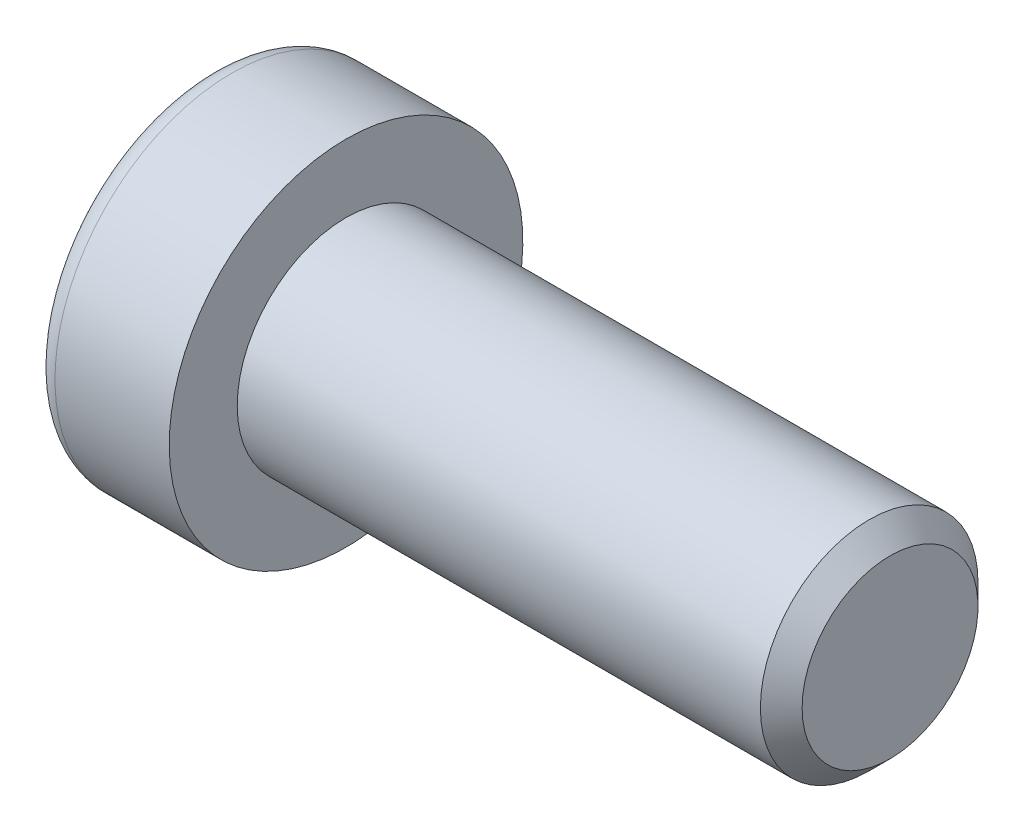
ISO-10303-21;
HEADER;
FILE_DESCRIPTION(('STEP AP214'),'2;1');
FILE_NAME('part.step','',(''),(''),'','','');
FILE_SCHEMA(('AUTOMOTIVE_DESIGN { 1 0 10303 214 1 1 1 1 }'));
ENDSEC;
DATA;
#1=APPLICATION_CONTEXT('core data for automotive mechanical design processes');
#2=APPLICATION_PROTOCOL_DEFINITION('international standard','automotive_design',2000,#1);
#3=PRODUCT_CONTEXT('',#1,'mechanical');
#4=PRODUCT('Part','Part','',(#3));
#5=PRODUCT_RELATED_PRODUCT_CATEGORY('part','',(#4));
#6=PRODUCT_DEFINITION_FORMATION('','',#4);
#7=PRODUCT_DEFINITION_CONTEXT('part definition',#1,'design');
#8=PRODUCT_DEFINITION('design','',#6,#7);
#9=PRODUCT_DEFINITION_SHAPE('','',#8);
#10=(LENGTH_UNIT() NAMED_UNIT(*) SI_UNIT(.MILLI.,.METRE.));
#11=(NAMED_UNIT(*) PLANE_ANGLE_UNIT() SI_UNIT($,.RADIAN.));
#12=(NAMED_UNIT(*) SI_UNIT($,.STERADIAN.) SOLID_ANGLE_UNIT());
#13=UNCERTAINTY_MEASURE_WITH_UNIT(LENGTH_MEASURE(1.E-05),#10,'distance_accuracy_value','');
#14=(GEOMETRIC_REPRESENTATION_CONTEXT(3) GLOBAL_UNCERTAINTY_ASSIGNED_CONTEXT((#13)) GLOBAL_UNIT_ASSIGNED_CONTEXT((#10,
#11,#12)) REPRESENTATION_CONTEXT('',''));
#15=CARTESIAN_POINT('',(0.,0.,0.));
#16=DIRECTION('',(0.,0.,1.));
#17=DIRECTION('',(1.,0.,0.));
#18=AXIS2_PLACEMENT_3D('',#15,#16,#17);
#19=CARTESIAN_POINT('',(-1.21000000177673,0.,0.));
#20=DIRECTION('',(-1.,0.,0.));
#21=DIRECTION('',(0.,0.,1.));
#22=AXIS2_PLACEMENT_3D('',#19,#20,#21);
#23=CONICAL_SURFACE('',#22,2.9040718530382,1.04719754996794);
#24=CARTESIAN_POINT('',(0.466666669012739,-1.13686837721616E-10,0.));
#25=VERTEX_POINT('',#24);
#26=VERTEX_LOOP('',#25);
#27=FACE_BOUND('',#26,.T.);
#28=CARTESIAN_POINT('',(-1.20000000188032,2.50000000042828,1.44337567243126));
#29=CARTESIAN_POINT('',(-1.16336943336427,2.50000000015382,1.31652043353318));
#30=CARTESIAN_POINT('',(-1.13005584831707,2.50000000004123,1.18857018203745));
#31=CARTESIAN_POINT('',(-1.07190798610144,2.49999999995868,0.930454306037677));
#32=CARTESIAN_POINT('',(-1.04709427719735,2.49999999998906,0.800284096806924));
#33=CARTESIAN_POINT('',(-1.00846995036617,2.50000000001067,0.541556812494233));
#34=CARTESIAN_POINT('',(-0.994402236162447,2.50000000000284,0.413039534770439));
#35=CARTESIAN_POINT('',(-0.977611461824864,2.49999999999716,0.155400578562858));
#36=CARTESIAN_POINT('',(-0.974874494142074,2.49999999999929,0.02627983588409));
#37=CARTESIAN_POINT('',(-0.980582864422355,2.50000000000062,-0.21496841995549));
#38=CARTESIAN_POINT('',(-0.987626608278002,2.50000000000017,-0.327132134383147));
#39=CARTESIAN_POINT('',(-1.00994662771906,2.49999999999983,-0.550728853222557));
#40=CARTESIAN_POINT('',(-1.02523052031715,2.49999999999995,-0.66216108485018));
#41=CARTESIAN_POINT('',(-1.06343729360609,2.50000000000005,-0.886218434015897));
#42=CARTESIAN_POINT('',(-1.08652205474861,2.50000000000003,-0.998815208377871));
#43=CARTESIAN_POINT('',(-1.13891470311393,2.49999999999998,-1.2223298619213));
#44=CARTESIAN_POINT('',(-1.16821028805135,2.49999999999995,-1.33325060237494));
#45=CARTESIAN_POINT('',(-1.20000000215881,2.5,-1.44337567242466));
#46=B_SPLINE_CURVE_WITH_KNOTS('',3,(#28,#29,#30,#31,#32,#33,#34,#35,#36,#37,#38,#39,#40,#41,#42,
#43,#44,#45),.UNSPECIFIED.,.F.,.F.,(4,2,2,2,2,2,2,2,4),(0.,0.396270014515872,0.793492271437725,
1.18088450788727,1.56780111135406,1.90463472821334,2.24178024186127,2.58640202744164,
2.93034746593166),.UNSPECIFIED.);
#47=CARTESIAN_POINT('',(-1.20000000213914,2.49999999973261,1.44337567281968));
#48=VERTEX_POINT('',#47);
#49=CARTESIAN_POINT('',(-1.20000000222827,2.5,-1.44337567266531));
#50=VERTEX_POINT('',#49);
#51=EDGE_CURVE('E20',#48,#50,#46,.T.);
#52=ORIENTED_EDGE('',*,*,#51,.T.);
#53=CARTESIAN_POINT('',(-1.20000000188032,2.49999999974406,-1.44337567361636));
#54=CARTESIAN_POINT('',(-1.16336943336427,2.39014014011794,-1.50680329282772));
#55=CARTESIAN_POINT('',(-1.13005584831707,2.27933197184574,-1.57077841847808));
#56=CARTESIAN_POINT('',(-1.07190798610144,2.05579706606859,-1.69983635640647));
#57=CARTESIAN_POINT('',(-1.04709427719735,1.94306635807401,-1.76492146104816));
#58=CARTESIAN_POINT('',(-1.00846995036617,1.71900195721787,-1.89428510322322));
#59=CARTESIAN_POINT('',(-0.994402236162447,1.60770272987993,-1.95854374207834));
#60=CARTESIAN_POINT('',(-0.977611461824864,1.38458084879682,-2.08736322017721));
#61=CARTESIAN_POINT('',(-0.974874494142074,1.27275900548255,-2.15192359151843));
#62=CARTESIAN_POINT('',(-0.980582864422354,1.06383188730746,-2.27254771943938));
#63=CARTESIAN_POINT('',(-0.987626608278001,0.966695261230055,-2.32862957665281));
#64=CARTESIAN_POINT('',(-1.00994662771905,0.773054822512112,-2.44042793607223));
#65=CARTESIAN_POINT('',(-1.02523052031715,0.676551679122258,-2.49614405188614));
#66=CARTESIAN_POINT('',(-1.06343729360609,0.482512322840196,-2.60817272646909));
#67=CARTESIAN_POINT('',(-1.08652205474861,0.385000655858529,-2.66447111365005));
#68=CARTESIAN_POINT('',(-1.13891470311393,0.191431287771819,-2.77622844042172));
#69=CARTESIAN_POINT('',(-1.16821028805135,0.09537110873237,-2.83168881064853));
#70=CARTESIAN_POINT('',(-1.20000000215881,4.75795596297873E-10,-2.88675134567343));
#71=B_SPLINE_CURVE_WITH_KNOTS('',3,(#53,#54,#55,#56,#57,#58,#59,#60,#61,#62,#63,#64,#65,#66,#67,
#68,#69,#70),.UNSPECIFIED.,.F.,.F.,(4,2,2,2,2,2,2,2,4),(0.,0.396270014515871,0.793492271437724,
1.18088450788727,1.56780111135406,1.90463472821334,2.24178024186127,2.58640202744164,
2.93034746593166),.UNSPECIFIED.);
#72=CARTESIAN_POINT('',(-1.20000000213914,0.,-2.88675134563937));
#73=VERTEX_POINT('',#72);
#74=EDGE_CURVE('E80',#50,#73,#71,.T.);
#75=ORIENTED_EDGE('',*,*,#74,.T.);
#76=CARTESIAN_POINT('',(-1.20000000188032,-6.84219602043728E-10,-2.88675134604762));
#77=CARTESIAN_POINT('',(-1.16336943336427,-0.109859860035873,-2.8233237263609));
#78=CARTESIAN_POINT('',(-1.13005584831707,-0.220668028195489,-2.75934860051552));
#79=CARTESIAN_POINT('',(-1.07190798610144,-0.444202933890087,-2.63029066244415));
#80=CARTESIAN_POINT('',(-1.04709427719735,-0.556933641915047,-2.56520555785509));
#81=CARTESIAN_POINT('',(-1.00846995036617,-0.780998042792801,-2.43584191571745));
#82=CARTESIAN_POINT('',(-0.994402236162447,-0.892297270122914,-2.37158327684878));
#83=CARTESIAN_POINT('',(-0.977611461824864,-1.11541915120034,-2.24276379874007));
#84=CARTESIAN_POINT('',(-0.974874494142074,-1.22724099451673,-2.17820342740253));
#85=CARTESIAN_POINT('',(-0.980582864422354,-1.43616811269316,-2.05757929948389));
#86=CARTESIAN_POINT('',(-0.987626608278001,-1.53330473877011,-2.00149744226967));
#87=CARTESIAN_POINT('',(-1.00994662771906,-1.72694517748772,-1.88969908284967));
#88=CARTESIAN_POINT('',(-1.02523052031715,-1.82344832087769,-1.83398296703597));
#89=CARTESIAN_POINT('',(-1.06343729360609,-2.01748767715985,-1.72195429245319));
#90=CARTESIAN_POINT('',(-1.08652205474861,-2.1149993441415,-1.66565590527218));
#91=CARTESIAN_POINT('',(-1.13891470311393,-2.30856871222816,-1.55389857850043));
#92=CARTESIAN_POINT('',(-1.16821028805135,-2.40462889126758,-1.49843820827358));
#93=CARTESIAN_POINT('',(-1.20000000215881,-2.49999999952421,-1.44337567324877));
#94=B_SPLINE_CURVE_WITH_KNOTS('',3,(#76,#77,#78,#79,#80,#81,#82,#83,#84,#85,#86,#87,#88,#89,#90,
#91,#92,#93),.UNSPECIFIED.,.F.,.F.,(4,2,2,2,2,2,2,2,4),(0.,0.396270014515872,0.793492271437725,
1.18088450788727,1.56780111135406,1.90463472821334,2.24178024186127,2.58640202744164,
2.93034746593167),.UNSPECIFIED.);
#95=CARTESIAN_POINT('',(-1.20000000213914,-2.49999999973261,-1.44337567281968));
#96=VERTEX_POINT('',#95);
#97=EDGE_CURVE('E105',#73,#96,#94,.T.);
#98=ORIENTED_EDGE('',*,*,#97,.T.);
#99=CARTESIAN_POINT('',(-1.20000000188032,-2.50000000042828,-1.44337567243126));
#100=CARTESIAN_POINT('',(-1.16336943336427,-2.50000000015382,-1.31652043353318));
#101=CARTESIAN_POINT('',(-1.13005584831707,-2.50000000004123,-1.18857018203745));
#102=CARTESIAN_POINT('',(-1.07190798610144,-2.49999999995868,-0.93045430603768));
#103=CARTESIAN_POINT('',(-1.04709427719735,-2.49999999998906,-0.800284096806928));
#104=CARTESIAN_POINT('',(-1.00846995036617,-2.50000000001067,-0.541556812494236));
#105=CARTESIAN_POINT('',(-0.994402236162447,-2.50000000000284,-0.413039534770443));
#106=CARTESIAN_POINT('',(-0.977611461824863,-2.49999999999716,-0.155400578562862));
#107=CARTESIAN_POINT('',(-0.974874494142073,-2.49999999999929,-0.0262798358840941));
#108=CARTESIAN_POINT('',(-0.980582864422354,-2.50000000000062,0.214968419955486));
#109=CARTESIAN_POINT('',(-0.987626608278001,-2.50000000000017,0.327132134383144));
#110=CARTESIAN_POINT('',(-1.00994662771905,-2.49999999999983,0.550728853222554));
#111=CARTESIAN_POINT('',(-1.02523052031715,-2.49999999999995,0.662161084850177));
#112=CARTESIAN_POINT('',(-1.06343729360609,-2.50000000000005,0.886218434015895));
#113=CARTESIAN_POINT('',(-1.08652205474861,-2.50000000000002,0.99881520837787));
#114=CARTESIAN_POINT('',(-1.13891470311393,-2.49999999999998,1.2223298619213));
#115=CARTESIAN_POINT('',(-1.16821028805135,-2.49999999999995,1.33325060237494));
#116=CARTESIAN_POINT('',(-1.20000000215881,-2.5,1.44337567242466));
#117=B_SPLINE_CURVE_WITH_KNOTS('',3,(#99,#100,#101,#102,#103,#104,#105,#106,#107,#108,#109,#110,
#111,#112,#113,#114,#115,#116),.UNSPECIFIED.,.F.,.F.,(4,2,2,2,2,2,2,2,4),(0.,0.396270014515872,
0.793492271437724,1.18088450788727,1.56780111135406,1.90463472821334,2.24178024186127,
2.58640202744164,2.93034746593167),.UNSPECIFIED.);
#118=CARTESIAN_POINT('',(-1.20000000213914,-2.49999999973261,1.44337567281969));
#119=VERTEX_POINT('',#118);
#120=EDGE_CURVE('E129',#96,#119,#117,.T.);
#121=ORIENTED_EDGE('',*,*,#120,.T.);
#122=CARTESIAN_POINT('',(-1.20000000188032,-2.49999999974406,1.44337567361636));
#123=CARTESIAN_POINT('',(-1.16336943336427,-2.39014014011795,1.50680329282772));
#124=CARTESIAN_POINT('',(-1.13005584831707,-2.27933197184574,1.57077841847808));
#125=CARTESIAN_POINT('',(-1.07190798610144,-2.05579706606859,1.69983635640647));
#126=CARTESIAN_POINT('',(-1.04709427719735,-1.94306635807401,1.76492146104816));
#127=CARTESIAN_POINT('',(-1.00846995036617,-1.71900195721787,1.89428510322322));
#128=CARTESIAN_POINT('',(-0.994402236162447,-1.60770272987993,1.95854374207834));
#129=CARTESIAN_POINT('',(-0.977611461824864,-1.38458084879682,2.08736322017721));
#130=CARTESIAN_POINT('',(-0.974874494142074,-1.27275900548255,2.15192359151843));
#131=CARTESIAN_POINT('',(-0.980582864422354,-1.06383188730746,2.27254771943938));
#132=CARTESIAN_POINT('',(-0.987626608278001,-0.966695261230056,2.32862957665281));
#133=CARTESIAN_POINT('',(-1.00994662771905,-0.773054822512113,2.44042793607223));
#134=CARTESIAN_POINT('',(-1.02523052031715,-0.676551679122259,2.49614405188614));
#135=CARTESIAN_POINT('',(-1.06343729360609,-0.482512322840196,2.60817272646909));
#136=CARTESIAN_POINT('',(-1.08652205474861,-0.385000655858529,2.66447111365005));
#137=CARTESIAN_POINT('',(-1.13891470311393,-0.19143128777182,2.77622844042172));
#138=CARTESIAN_POINT('',(-1.16821028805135,-0.0953711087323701,2.83168881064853));
#139=CARTESIAN_POINT('',(-1.20000000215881,-4.7579556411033E-10,2.88675134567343));
#140=B_SPLINE_CURVE_WITH_KNOTS('',3,(#122,#123,#124,#125,#126,#127,#128,#129,#130,#131,#132,
#133,#134,#135,#136,#137,#138,#139),.UNSPECIFIED.,.F.,.F.,(4,2,2,2,2,2,2,2,4),(0.,
0.396270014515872,0.793492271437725,1.18088450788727,1.56780111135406,1.90463472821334,
2.24178024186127,2.58640202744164,2.93034746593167),.UNSPECIFIED.);
#141=CARTESIAN_POINT('',(-1.20000000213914,0.,2.88675134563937));
#142=VERTEX_POINT('',#141);
#143=EDGE_CURVE('E137',#119,#142,#140,.T.);
#144=ORIENTED_EDGE('',*,*,#143,.T.);
#145=CARTESIAN_POINT('',(-1.20000000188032,6.84218409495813E-10,2.88675134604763));
#146=CARTESIAN_POINT('',(-1.16336943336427,0.109859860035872,2.8233237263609));
#147=CARTESIAN_POINT('',(-1.13005584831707,0.220668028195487,2.75934860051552));
#148=CARTESIAN_POINT('',(-1.07190798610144,0.444202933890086,2.63029066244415));
#149=CARTESIAN_POINT('',(-1.04709427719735,0.556933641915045,2.56520555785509));
#150=CARTESIAN_POINT('',(-1.00846995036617,0.780998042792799,2.43584191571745));
#151=CARTESIAN_POINT('',(-0.994402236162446,0.892297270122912,2.37158327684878));
#152=CARTESIAN_POINT('',(-0.977611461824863,1.11541915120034,2.24276379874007));
#153=CARTESIAN_POINT('',(-0.974874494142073,1.22724099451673,2.17820342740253));
#154=CARTESIAN_POINT('',(-0.980582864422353,1.43616811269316,2.05757929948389));
#155=CARTESIAN_POINT('',(-0.987626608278,1.53330473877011,2.00149744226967));
#156=CARTESIAN_POINT('',(-1.00994662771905,1.72694517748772,1.88969908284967));
#157=CARTESIAN_POINT('',(-1.02523052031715,1.82344832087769,1.83398296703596));
#158=CARTESIAN_POINT('',(-1.06343729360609,2.01748767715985,1.72195429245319));
#159=CARTESIAN_POINT('',(-1.08652205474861,2.1149993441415,1.66565590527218));
#160=CARTESIAN_POINT('',(-1.13891470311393,2.30856871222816,1.55389857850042));
#161=CARTESIAN_POINT('',(-1.16821028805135,2.40462889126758,1.49843820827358));
#162=CARTESIAN_POINT('',(-1.2000000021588,2.49999999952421,1.44337567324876));
#163=B_SPLINE_CURVE_WITH_KNOTS('',3,(#145,#146,#147,#148,#149,#150,#151,#152,#153,#154,#155,
#156,#157,#158,#159,#160,#161,#162),.UNSPECIFIED.,.F.,.F.,(4,2,2,2,2,2,2,2,4),(0.,
0.396270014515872,0.793492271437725,1.18088450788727,1.56780111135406,1.90463472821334,
2.24178024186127,2.58640202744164,2.93034746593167),.UNSPECIFIED.);
#164=EDGE_CURVE('E82',#142,#48,#163,.T.);
#165=ORIENTED_EDGE('',*,*,#164,.T.);
#166=EDGE_LOOP('',(#52,#75,#98,#121,#144,#165));
#167=FACE_BOUND('',#166,.T.);
#168=ADVANCED_FACE('F16',(#27,#167),#23,.F.);
#169=CARTESIAN_POINT('',(-5.,2.5,1.44337567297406));
#170=DIRECTION('',(0.,1.,0.));
#171=DIRECTION('',(0.,0.,1.));
#172=AXIS2_PLACEMENT_3D('',#169,#170,#171);
#173=PLANE('',#172);
#174=DIRECTION('',(1.,0.,0.));
#175=VECTOR('',#174,1.);
#176=CARTESIAN_POINT('',(-5.,2.5,1.44337567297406));
#177=LINE('',#176,#175);
#178=CARTESIAN_POINT('',(-5.,2.5,1.44337567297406));
#179=VERTEX_POINT('',#178);
#180=EDGE_CURVE('E84',#48,#179,#177,.F.);
#181=ORIENTED_EDGE('',*,*,#180,.T.);
#182=DIRECTION('',(0.,0.,1.));
#183=VECTOR('',#182,1.);
#184=CARTESIAN_POINT('',(-5.,2.5,0.));
#185=LINE('',#184,#183);
#186=CARTESIAN_POINT('',(-5.,2.5,-1.44337567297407));
#187=VERTEX_POINT('',#186);
#188=EDGE_CURVE('E89',#187,#179,#185,.T.);
#189=ORIENTED_EDGE('',*,*,#188,.F.);
#190=DIRECTION('',(1.,0.,0.));
#191=VECTOR('',#190,1.);
#192=CARTESIAN_POINT('',(-5.,2.5,-1.44337567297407));
#193=LINE('',#192,#191);
#194=EDGE_CURVE('E87',#187,#50,#193,.T.);
#195=ORIENTED_EDGE('',*,*,#194,.T.);
#196=ORIENTED_EDGE('',*,*,#51,.F.);
#197=EDGE_LOOP('',(#181,#189,#195,#196));
#198=FACE_BOUND('',#197,.T.);
#199=ADVANCED_FACE('F76',(#198),#173,.F.);
#200=CARTESIAN_POINT('',(-5.,0.,2.88675134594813));
#201=DIRECTION('',(0.,0.500000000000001,0.866025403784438));
#202=DIRECTION('',(0.,-0.866025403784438,0.500000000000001));
#203=AXIS2_PLACEMENT_3D('',#200,#201,#202);
#204=PLANE('',#203);
#205=DIRECTION('',(1.,0.,0.));
#206=VECTOR('',#205,1.);
#207=CARTESIAN_POINT('',(-5.,0.,2.88675134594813));
#208=LINE('',#207,#206);
#209=CARTESIAN_POINT('',(-5.,0.,2.88675134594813));
#210=VERTEX_POINT('',#209);
#211=EDGE_CURVE('E141',#142,#210,#208,.F.);
#212=ORIENTED_EDGE('',*,*,#211,.T.);
#213=DIRECTION('',(0.,-0.866025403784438,0.500000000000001));
#214=VECTOR('',#213,1.);
#215=CARTESIAN_POINT('',(-5.,2.5,1.44337567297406));
#216=LINE('',#215,#214);
#217=EDGE_CURVE('E95',#179,#210,#216,.T.);
#218=ORIENTED_EDGE('',*,*,#217,.F.);
#219=ORIENTED_EDGE('',*,*,#180,.F.);
#220=ORIENTED_EDGE('',*,*,#164,.F.);
#221=EDGE_LOOP('',(#212,#218,#219,#220));
#222=FACE_BOUND('',#221,.T.);
#223=ADVANCED_FACE('F145',(#222),#204,.F.);
#224=CARTESIAN_POINT('',(-5.,-2.5,1.44337567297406));
#225=DIRECTION('',(0.,-0.5,0.866025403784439));
#226=DIRECTION('',(0.,-0.866025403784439,-0.5));
#227=AXIS2_PLACEMENT_3D('',#224,#225,#226);
#228=PLANE('',#227);
#229=DIRECTION('',(1.,0.,0.));
#230=VECTOR('',#229,1.);
#231=CARTESIAN_POINT('',(-5.,-2.5,1.44337567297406));
#232=LINE('',#231,#230);
#233=CARTESIAN_POINT('',(-5.,-2.5,1.44337567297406));
#234=VERTEX_POINT('',#233);
#235=EDGE_CURVE('E136',#119,#234,#232,.F.);
#236=ORIENTED_EDGE('',*,*,#235,.T.);
#237=DIRECTION('',(0.,-0.866025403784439,-0.5));
#238=VECTOR('',#237,1.);
#239=CARTESIAN_POINT('',(-5.,0.,2.88675134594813));
#240=LINE('',#239,#238);
#241=EDGE_CURVE('E224',#210,#234,#240,.T.);
#242=ORIENTED_EDGE('',*,*,#241,.F.);
#243=ORIENTED_EDGE('',*,*,#211,.F.);
#244=ORIENTED_EDGE('',*,*,#143,.F.);
#245=EDGE_LOOP('',(#236,#242,#243,#244));
#246=FACE_BOUND('',#245,.T.);
#247=ADVANCED_FACE('F125',(#246),#228,.F.);
#248=CARTESIAN_POINT('',(-5.,-2.5,-1.44337567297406));
#249=DIRECTION('',(0.,-1.,0.));
#250=DIRECTION('',(0.,0.,-1.));
#251=AXIS2_PLACEMENT_3D('',#248,#249,#250);
#252=PLANE('',#251);
#253=DIRECTION('',(1.,0.,0.));
#254=VECTOR('',#253,1.);
#255=CARTESIAN_POINT('',(-5.,-2.5,-1.44337567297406));
#256=LINE('',#255,#254);
#257=CARTESIAN_POINT('',(-5.,-2.5,-1.44337567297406));
#258=VERTEX_POINT('',#257);
#259=EDGE_CURVE('E135',#96,#258,#256,.F.);
#260=ORIENTED_EDGE('',*,*,#259,.T.);
#261=DIRECTION('',(0.,0.,1.));
#262=VECTOR('',#261,1.);
#263=CARTESIAN_POINT('',(-5.,-2.5,0.));
#264=LINE('',#263,#262);
#265=EDGE_CURVE('E221',#234,#258,#264,.F.);
#266=ORIENTED_EDGE('',*,*,#265,.F.);
#267=ORIENTED_EDGE('',*,*,#235,.F.);
#268=ORIENTED_EDGE('',*,*,#120,.F.);
#269=EDGE_LOOP('',(#260,#266,#267,#268));
#270=FACE_BOUND('',#269,.T.);
#271=ADVANCED_FACE('F121',(#270),#252,.F.);
#272=CARTESIAN_POINT('',(-5.,0.,-2.88675134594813));
#273=DIRECTION('',(0.,-0.5,-0.866025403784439));
#274=DIRECTION('',(0.,0.866025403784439,-0.5));
#275=AXIS2_PLACEMENT_3D('',#272,#273,#274);
#276=PLANE('',#275);
#277=DIRECTION('',(1.,0.,0.));
#278=VECTOR('',#277,1.);
#279=CARTESIAN_POINT('',(-5.,0.,-2.88675134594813));
#280=LINE('',#279,#278);
#281=CARTESIAN_POINT('',(-5.,0.,-2.88675134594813));
#282=VERTEX_POINT('',#281);
#283=EDGE_CURVE('E38',#73,#282,#280,.F.);
#284=ORIENTED_EDGE('',*,*,#283,.T.);
#285=DIRECTION('',(0.,0.866025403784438,-0.500000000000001));
#286=VECTOR('',#285,1.);
#287=CARTESIAN_POINT('',(-5.,-2.5,-1.44337567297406));
#288=LINE('',#287,#286);
#289=EDGE_CURVE('E218',#258,#282,#288,.T.);
#290=ORIENTED_EDGE('',*,*,#289,.F.);
#291=ORIENTED_EDGE('',*,*,#259,.F.);
#292=ORIENTED_EDGE('',*,*,#97,.F.);
#293=EDGE_LOOP('',(#284,#290,#291,#292));
#294=FACE_BOUND('',#293,.T.);
#295=ADVANCED_FACE('F115',(#294),#276,.F.);
#296=CARTESIAN_POINT('',(-5.,2.5,-1.44337567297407));
#297=DIRECTION('',(0.,0.5,-0.866025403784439));
#298=DIRECTION('',(0.,0.866025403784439,0.5));
#299=AXIS2_PLACEMENT_3D('',#296,#297,#298);
#300=PLANE('',#299);
#301=ORIENTED_EDGE('',*,*,#194,.F.);
#302=DIRECTION('',(0.,0.866025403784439,0.5));
#303=VECTOR('',#302,1.);
#304=CARTESIAN_POINT('',(-5.,0.,-2.88675134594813));
#305=LINE('',#304,#303);
#306=EDGE_CURVE('E216',#282,#187,#305,.T.);
#307=ORIENTED_EDGE('',*,*,#306,.F.);
#308=ORIENTED_EDGE('',*,*,#283,.F.);
#309=ORIENTED_EDGE('',*,*,#74,.F.);
#310=EDGE_LOOP('',(#301,#307,#308,#309));
#311=FACE_BOUND('',#310,.T.);
#312=ADVANCED_FACE('F93',(#311),#300,.F.);
#313=CARTESIAN_POINT('',(-5.,4.69337567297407,0.));
#314=DIRECTION('',(-1.,0.,0.));
#315=DIRECTION('',(0.,0.,1.));
#316=AXIS2_PLACEMENT_3D('',#313,#314,#315);
#317=PLANE('',#316);
#318=ORIENTED_EDGE('',*,*,#289,.T.);
#319=ORIENTED_EDGE('',*,*,#306,.T.);
#320=ORIENTED_EDGE('',*,*,#188,.T.);
#321=ORIENTED_EDGE('',*,*,#217,.T.);
#322=ORIENTED_EDGE('',*,*,#241,.T.);
#323=ORIENTED_EDGE('',*,*,#265,.T.);
#324=EDGE_LOOP('',(#318,#319,#320,#321,#322,#323));
#325=FACE_BOUND('',#324,.T.);
#326=CARTESIAN_POINT('',(-5.,0.,0.));
#327=DIRECTION('',(1.,0.,0.));
#328=DIRECTION('',(0.,1.,0.));
#329=AXIS2_PLACEMENT_3D('',#326,#327,#328);
#330=CIRCLE('',#329,5.7);
#331=CARTESIAN_POINT('',(-5.,5.7,0.));
#332=VERTEX_POINT('',#331);
#333=EDGE_CURVE('E193',#332,#332,#330,.T.);
#334=ORIENTED_EDGE('',*,*,#333,.F.);
#335=EDGE_LOOP('',(#334));
#336=FACE_BOUND('',#335,.T.);
#337=ADVANCED_FACE('F114',(#325,#336),#317,.T.);
#338=CARTESIAN_POINT('',(-4.2,0.,0.));
#339=DIRECTION('',(1.,0.,0.));
#340=DIRECTION('',(0.,0.,-1.));
#341=AXIS2_PLACEMENT_3D('',#338,#339,#340);
#342=TOROIDAL_SURFACE('',#341,5.7,0.8);
#343=CARTESIAN_POINT('',(-4.2,0.,0.));
#344=DIRECTION('',(1.,0.,0.));
#345=DIRECTION('',(0.,1.,0.));
#346=AXIS2_PLACEMENT_3D('',#343,#344,#345);
#347=CIRCLE('',#346,6.5);
#348=CARTESIAN_POINT('',(-4.2,6.5,0.));
#349=VERTEX_POINT('',#348);
#350=EDGE_CURVE('E234',#349,#349,#347,.T.);
#351=ORIENTED_EDGE('',*,*,#350,.F.);
#352=EDGE_LOOP('',(#351));
#353=FACE_BOUND('',#352,.T.);
#354=ORIENTED_EDGE('',*,*,#333,.T.);
#355=EDGE_LOOP('',(#354));
#356=FACE_BOUND('',#355,.T.);
#357=ADVANCED_FACE('F177',(#353,#356),#342,.T.);
#358=CARTESIAN_POINT('',(-2.5,0.,0.));
#359=DIRECTION('',(1.,0.,0.));
#360=DIRECTION('',(0.,1.,0.));
#361=AXIS2_PLACEMENT_3D('',#358,#359,#360);
#362=CYLINDRICAL_SURFACE('',#361,6.5);
#363=ORIENTED_EDGE('',*,*,#350,.T.);
#364=EDGE_LOOP('',(#363));
#365=FACE_BOUND('',#364,.T.);
#366=CARTESIAN_POINT('',(0.,0.,0.));
#367=DIRECTION('',(1.,0.,0.));
#368=DIRECTION('',(0.,1.,0.));
#369=AXIS2_PLACEMENT_3D('',#366,#367,#368);
#370=CIRCLE('',#369,6.5);
#371=CARTESIAN_POINT('',(0.,6.5,0.));
#372=VERTEX_POINT('',#371);
#373=EDGE_CURVE('E103',#372,#372,#370,.T.);
#374=ORIENTED_EDGE('',*,*,#373,.F.);
#375=EDGE_LOOP('',(#374));
#376=FACE_BOUND('',#375,.T.);
#377=ADVANCED_FACE('F174',(#365,#376),#362,.T.);
#378=CARTESIAN_POINT('',(20.,2.,0.));
#379=DIRECTION('',(1.,0.,0.));
#380=DIRECTION('',(0.,0.,-1.));
#381=AXIS2_PLACEMENT_3D('',#378,#379,#380);
#382=PLANE('',#381);
#383=CARTESIAN_POINT('',(20.0000000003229,0.,0.));
#384=DIRECTION('',(-1.,0.,0.));
#385=DIRECTION('',(0.,0.,1.));
#386=AXIS2_PLACEMENT_3D('',#383,#384,#385);
#387=CIRCLE('',#386,3.23318750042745);
#388=CARTESIAN_POINT('',(20.0000000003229,0.,3.23318750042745));
#389=VERTEX_POINT('',#388);
#390=EDGE_CURVE('E230',#389,#389,#387,.T.);
#391=ORIENTED_EDGE('',*,*,#390,.F.);
#392=EDGE_LOOP('',(#391));
#393=FACE_BOUND('',#392,.T.);
#394=ADVANCED_FACE('F170',(#393),#382,.T.);
#395=CARTESIAN_POINT('',(0.,5.25,0.));
#396=DIRECTION('',(1.,0.,0.));
#397=DIRECTION('',(0.,0.,-1.));
#398=AXIS2_PLACEMENT_3D('',#395,#396,#397);
#399=PLANE('',#398);
#400=CARTESIAN_POINT('',(0.,0.,0.));
#401=DIRECTION('',(1.,0.,0.));
#402=DIRECTION('',(0.,1.,0.));
#403=AXIS2_PLACEMENT_3D('',#400,#401,#402);
#404=CIRCLE('',#403,4.);
#405=CARTESIAN_POINT('',(0.,4.,0.));
#406=VERTEX_POINT('',#405);
#407=EDGE_CURVE('E29',#406,#406,#404,.T.);
#408=ORIENTED_EDGE('',*,*,#407,.F.);
#409=EDGE_LOOP('',(#408));
#410=FACE_BOUND('',#409,.T.);
#411=ORIENTED_EDGE('',*,*,#373,.T.);
#412=EDGE_LOOP('',(#411));
#413=FACE_BOUND('',#412,.T.);
#414=ADVANCED_FACE('F163',(#410,#413),#399,.T.);
#415=CARTESIAN_POINT('',(19.2331874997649,0.,0.));
#416=DIRECTION('',(-1.,0.,0.));
#417=DIRECTION('',(0.,0.,1.));
#418=AXIS2_PLACEMENT_3D('',#415,#416,#417);
#419=CONICAL_SURFACE('',#418,3.99999999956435,0.78539816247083);
#420=ORIENTED_EDGE('',*,*,#390,.T.);
#421=EDGE_LOOP('',(#420));
#422=FACE_BOUND('',#421,.T.);
#423=CARTESIAN_POINT('',(19.2331875,0.,0.));
#424=DIRECTION('',(1.,0.,0.));
#425=DIRECTION('',(0.,1.,0.));
#426=AXIS2_PLACEMENT_3D('',#423,#424,#425);
#427=CIRCLE('',#426,4.);
#428=CARTESIAN_POINT('',(19.2331875,4.,0.));
#429=VERTEX_POINT('',#428);
#430=EDGE_CURVE('E11',#429,#429,#427,.F.);
#431=ORIENTED_EDGE('',*,*,#430,.F.);
#432=EDGE_LOOP('',(#431));
#433=FACE_BOUND('',#432,.T.);
#434=ADVANCED_FACE('F156',(#422,#433),#419,.T.);
#435=CARTESIAN_POINT('',(10.5,0.,0.));
#436=DIRECTION('',(1.,0.,0.));
#437=DIRECTION('',(0.,1.,0.));
#438=AXIS2_PLACEMENT_3D('',#435,#436,#437);
#439=CYLINDRICAL_SURFACE('',#438,4.);
#440=ORIENTED_EDGE('',*,*,#430,.T.);
#441=EDGE_LOOP('',(#440));
#442=FACE_BOUND('',#441,.T.);
#443=ORIENTED_EDGE('',*,*,#407,.T.);
#444=EDGE_LOOP('',(#443));
#445=FACE_BOUND('',#444,.T.);
#446=ADVANCED_FACE('F154',(#442,#445),#439,.T.);
#447=CLOSED_SHELL('',(#168,#199,#223,#247,#271,#295,#312,#337,#357,#377,#394,#414,#434,#446));
#448=MANIFOLD_SOLID_BREP('B1',#447);
#449=ADVANCED_BREP_SHAPE_REPRESENTATION('',(#18,#448),#14);
#450=SHAPE_DEFINITION_REPRESENTATION(#9,#449);
ENDSEC;
END-ISO-10303-21;
